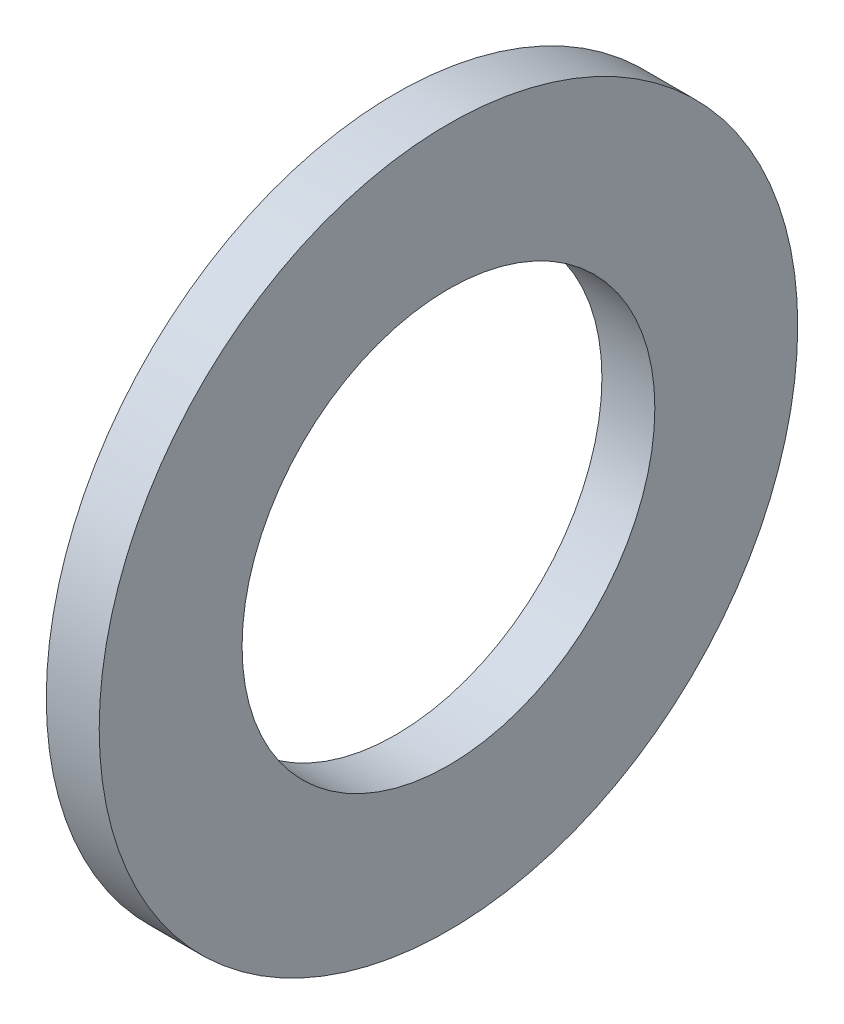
from build123d import *

# Parameters (mm, degrees)
SKETCH1_W = 5
SKETCH1_H = 13.5


with BuildPart() as part:
    # Sketch1 → Base-Revolve (revolve)
    with BuildSketch(Plane.XY, mode=Mode.PRIVATE) as base_revolve_sk:
        with Locations((-2.5, 26.25)):
            Rectangle(SKETCH1_W, SKETCH1_H)
    revolve(base_revolve_sk.sketch.rotate(Axis((-34.925, 0, 0), (1, 0, 0)), 90), axis=Axis((-34.925, 0, 0), (1, 0, 0)))


solid = part.part
